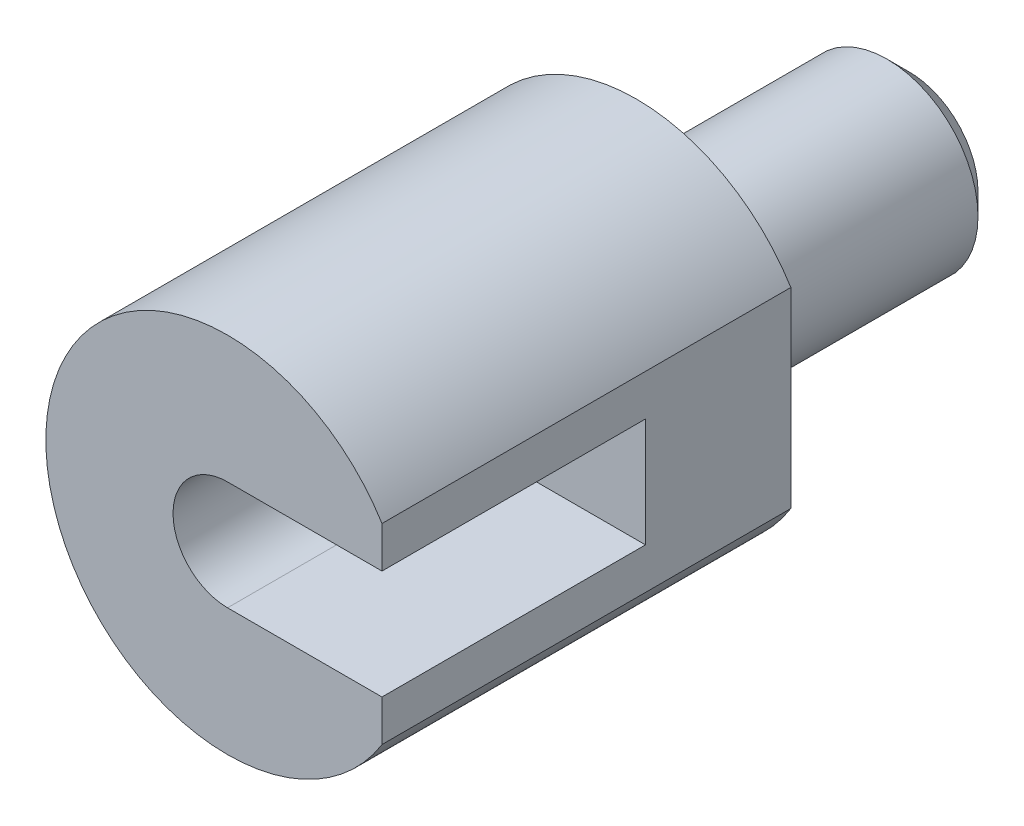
ISO-10303-21;
HEADER;
FILE_DESCRIPTION(('STEP AP214'),'2;1');
FILE_NAME('part.step','',(''),(''),'','','');
FILE_SCHEMA(('AUTOMOTIVE_DESIGN { 1 0 10303 214 1 1 1 1 }'));
ENDSEC;
DATA;
#1=APPLICATION_CONTEXT('core data for automotive mechanical design processes');
#2=APPLICATION_PROTOCOL_DEFINITION('international standard','automotive_design',2000,#1);
#3=PRODUCT_CONTEXT('',#1,'mechanical');
#4=PRODUCT('Part','Part','',(#3));
#5=PRODUCT_RELATED_PRODUCT_CATEGORY('part','',(#4));
#6=PRODUCT_DEFINITION_FORMATION('','',#4);
#7=PRODUCT_DEFINITION_CONTEXT('part definition',#1,'design');
#8=PRODUCT_DEFINITION('design','',#6,#7);
#9=PRODUCT_DEFINITION_SHAPE('','',#8);
#10=(LENGTH_UNIT() NAMED_UNIT(*) SI_UNIT(.MILLI.,.METRE.));
#11=(NAMED_UNIT(*) PLANE_ANGLE_UNIT() SI_UNIT($,.RADIAN.));
#12=(NAMED_UNIT(*) SI_UNIT($,.STERADIAN.) SOLID_ANGLE_UNIT());
#13=UNCERTAINTY_MEASURE_WITH_UNIT(LENGTH_MEASURE(1.E-05),#10,'distance_accuracy_value','');
#14=(GEOMETRIC_REPRESENTATION_CONTEXT(3) GLOBAL_UNCERTAINTY_ASSIGNED_CONTEXT((#13)) GLOBAL_UNIT_ASSIGNED_CONTEXT((#10,
#11,#12)) REPRESENTATION_CONTEXT('',''));
#15=CARTESIAN_POINT('',(0.,0.,0.));
#16=DIRECTION('',(0.,0.,1.));
#17=DIRECTION('',(1.,0.,0.));
#18=AXIS2_PLACEMENT_3D('',#15,#16,#17);
#19=CARTESIAN_POINT('',(0.,0.,0.));
#20=DIRECTION('',(0.,0.,1.));
#21=DIRECTION('',(1.,0.,0.));
#22=AXIS2_PLACEMENT_3D('',#19,#20,#21);
#23=CYLINDRICAL_SURFACE('',#22,3.);
#24=CARTESIAN_POINT('',(0.,0.,8.));
#25=DIRECTION('',(0.,0.,-1.));
#26=DIRECTION('',(-1.,0.,0.));
#27=AXIS2_PLACEMENT_3D('',#24,#25,#26);
#28=CIRCLE('',#27,3.);
#29=CARTESIAN_POINT('',(0.,3.,8.));
#30=VERTEX_POINT('',#29);
#31=CARTESIAN_POINT('',(0.,-3.,8.));
#32=VERTEX_POINT('',#31);
#33=EDGE_CURVE('E29',#30,#32,#28,.F.);
#34=ORIENTED_EDGE('',*,*,#33,.F.);
#35=DIRECTION('',(0.,0.,1.));
#36=VECTOR('',#35,1.);
#37=CARTESIAN_POINT('',(0.,3.,0.));
#38=LINE('',#37,#36);
#39=CARTESIAN_POINT('',(0.,3.,12.));
#40=VERTEX_POINT('',#39);
#41=EDGE_CURVE('E105',#30,#40,#38,.T.);
#42=ORIENTED_EDGE('',*,*,#41,.T.);
#43=CARTESIAN_POINT('',(1.5,2.59807621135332,13.5));
#44=CARTESIAN_POINT('',(1.4999945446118,2.59808302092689,13.5781617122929));
#45=CARTESIAN_POINT('',(1.49384995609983,2.60165701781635,13.6564221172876));
#46=CARTESIAN_POINT('',(1.46958481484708,2.61543549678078,13.8105408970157));
#47=CARTESIAN_POINT('',(1.45143909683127,2.62565391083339,13.8863938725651));
#48=CARTESIAN_POINT('',(1.40414992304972,2.65124019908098,14.0331774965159));
#49=CARTESIAN_POINT('',(1.3750649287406,2.66658065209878,14.1041319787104));
#50=CARTESIAN_POINT('',(1.30690128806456,2.70063997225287,14.2401363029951));
#51=CARTESIAN_POINT('',(1.26782210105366,2.71935902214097,14.3051858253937));
#52=CARTESIAN_POINT('',(1.17699981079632,2.75995303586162,14.4334585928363));
#53=CARTESIAN_POINT('',(1.12447805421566,2.7819609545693,14.4960887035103));
#54=CARTESIAN_POINT('',(1.0098807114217,2.82557974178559,14.6121125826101));
#55=CARTESIAN_POINT('',(0.947800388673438,2.84719040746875,14.6655017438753));
#56=CARTESIAN_POINT('',(0.810734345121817,2.88932215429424,14.7650507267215));
#57=CARTESIAN_POINT('',(0.735160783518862,2.90967159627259,14.8104806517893));
#58=CARTESIAN_POINT('',(0.576235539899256,2.94526134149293,14.8877112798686));
#59=CARTESIAN_POINT('',(0.492888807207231,2.96050486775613,14.9195205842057));
#60=CARTESIAN_POINT('',(0.327067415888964,2.98320691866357,14.9662569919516));
#61=CARTESIAN_POINT('',(0.244952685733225,2.99114220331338,14.9822242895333));
#62=CARTESIAN_POINT('',(0.0788559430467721,3.000113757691,15.0002491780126));
#63=CARTESIAN_POINT('',(-0.00512490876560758,3.00115420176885,15.0023151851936));
#64=CARTESIAN_POINT('',(-0.164748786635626,2.99644472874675,14.9928799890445));
#65=CARTESIAN_POINT('',(-0.24048179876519,2.99127743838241,14.9825429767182));
#66=CARTESIAN_POINT('',(-0.388970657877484,2.97561367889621,14.950678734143));
#67=CARTESIAN_POINT('',(-0.461726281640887,2.96511681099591,14.9291506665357));
#68=CARTESIAN_POINT('',(-0.60346408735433,2.93957374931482,14.8753761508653));
#69=CARTESIAN_POINT('',(-0.67238013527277,2.92446662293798,14.8429855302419));
#70=CARTESIAN_POINT('',(-0.803965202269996,2.89106468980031,14.7686048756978));
#71=CARTESIAN_POINT('',(-0.866631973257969,2.87276874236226,14.7266114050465));
#72=CARTESIAN_POINT('',(-0.990260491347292,2.83266591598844,14.6296569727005));
#73=CARTESIAN_POINT('',(-1.05050111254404,2.81069063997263,14.573845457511));
#74=CARTESIAN_POINT('',(-1.16115655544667,2.76681510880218,14.4531154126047));
#75=CARTESIAN_POINT('',(-1.21156381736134,2.74491492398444,14.3881899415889));
#76=CARTESIAN_POINT('',(-1.30425800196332,2.70216234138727,14.2460277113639));
#77=CARTESIAN_POINT('',(-1.34582597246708,2.68146479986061,14.1682709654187));
#78=CARTESIAN_POINT('',(-1.41497866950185,2.64563175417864,14.0055934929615));
#79=CARTESIAN_POINT('',(-1.44257798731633,2.63049045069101,13.9206803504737));
#80=CARTESIAN_POINT('',(-1.48077031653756,2.60916953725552,13.7531782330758));
#81=CARTESIAN_POINT('',(-1.49253768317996,2.60237483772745,13.6709383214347));
#82=CARTESIAN_POINT('',(-1.50227541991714,2.59676879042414,13.5053979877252));
#83=CARTESIAN_POINT('',(-1.50025553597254,2.59795180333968,13.4220983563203));
#84=CARTESIAN_POINT('',(-1.48355406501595,2.60751504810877,13.2665191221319));
#85=CARTESIAN_POINT('',(-1.4702817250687,2.61509381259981,13.1940308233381));
#86=CARTESIAN_POINT('',(-1.43354442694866,2.63541032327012,13.0524483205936));
#87=CARTESIAN_POINT('',(-1.41007616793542,2.64814974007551,12.9833552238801));
#88=CARTESIAN_POINT('',(-1.35247138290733,2.67804333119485,12.846883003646));
#89=CARTESIAN_POINT('',(-1.31789109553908,2.69537464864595,12.7797314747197));
#90=CARTESIAN_POINT('',(-1.2394305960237,2.73234179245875,12.6517960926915));
#91=CARTESIAN_POINT('',(-1.19554560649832,2.75197880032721,12.5910155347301));
#92=CARTESIAN_POINT('',(-1.09325575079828,2.79431997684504,12.4695318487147));
#93=CARTESIAN_POINT('',(-1.03371790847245,2.81709874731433,12.4098042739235));
#94=CARTESIAN_POINT('',(-0.905106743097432,2.86101352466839,12.3008816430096));
#95=CARTESIAN_POINT('',(-0.836030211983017,2.88214897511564,12.2516901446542));
#96=CARTESIAN_POINT('',(-0.687803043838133,2.92112042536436,12.1641394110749));
#97=CARTESIAN_POINT('',(-0.608434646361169,2.93885462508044,12.1261003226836));
#98=CARTESIAN_POINT('',(-0.443283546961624,2.96825032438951,12.0642931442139));
#99=CARTESIAN_POINT('',(-0.357506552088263,2.9799171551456,12.0405125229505));
#100=CARTESIAN_POINT('',(-0.190469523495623,2.99501262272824,12.009947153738));
#101=CARTESIAN_POINT('',(-0.109517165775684,2.99909891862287,12.0018031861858));
#102=CARTESIAN_POINT('',(0.0526889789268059,3.00063195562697,11.9987351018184));
#103=CARTESIAN_POINT('',(0.13394265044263,2.99808102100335,12.0038063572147));
#104=CARTESIAN_POINT('',(0.288806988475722,2.98700953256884,12.0261246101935));
#105=CARTESIAN_POINT('',(0.362568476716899,2.97889342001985,12.0425472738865));
#106=CARTESIAN_POINT('',(0.506168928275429,2.95788140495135,12.0859904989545));
#107=CARTESIAN_POINT('',(0.576007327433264,2.94498481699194,12.1130125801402));
#108=CARTESIAN_POINT('',(0.713135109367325,2.91488896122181,12.178090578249));
#109=CARTESIAN_POINT('',(0.780187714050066,2.89752925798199,12.2165689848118));
#110=CARTESIAN_POINT('',(0.907161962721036,2.86032199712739,12.3029368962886));
#111=CARTESIAN_POINT('',(0.967080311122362,2.84047329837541,12.3508307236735));
#112=CARTESIAN_POINT('',(1.08437100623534,2.79792915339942,12.460195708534));
#113=CARTESIAN_POINT('',(1.14089652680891,2.77514698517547,12.5225437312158));
#114=CARTESIAN_POINT('',(1.24299493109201,2.73094614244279,12.6561760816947));
#115=CARTESIAN_POINT('',(1.28855812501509,2.70952868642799,12.7274682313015));
#116=CARTESIAN_POINT('',(1.36864661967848,2.66999407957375,12.8799549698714));
#117=CARTESIAN_POINT('',(1.40277759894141,2.65200261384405,12.9613912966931));
#118=CARTESIAN_POINT('',(1.45631806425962,2.62299234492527,13.1299986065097));
#119=CARTESIAN_POINT('',(1.47577678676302,2.61195024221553,13.217149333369));
#120=CARTESIAN_POINT('',(1.49155051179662,2.60293908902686,13.337708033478));
#121=CARTESIAN_POINT('',(1.49471415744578,2.60112193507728,13.3700518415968));
#122=CARTESIAN_POINT('',(1.49894010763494,2.59868903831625,13.4349247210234));
#123=CARTESIAN_POINT('',(1.50000227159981,2.59807337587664,13.4674538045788));
#124=CARTESIAN_POINT('',(1.5,2.59807621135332,13.5));
#125=B_SPLINE_CURVE_WITH_KNOTS('',3,(#43,#44,#45,#46,#47,#48,#49,#50,#51,#52,#53,#54,#55,#56,
#57,#58,#59,#60,#61,#62,#63,#64,#65,#66,#67,#68,#69,#70,#71,#72,#73,#74,#75,#76,#77,#78,#79,#80,
#81,#82,#83,#84,#85,#86,#87,#88,#89,#90,#91,#92,#93,#94,#95,#96,#97,#98,#99,#100,#101,#102,#103,
#104,#105,#106,#107,#108,#109,#110,#111,#112,#113,#114,#115,#116,#117,#118,#119,#120,#121,#122,
#123,#124),.UNSPECIFIED.,.T.,.F.,(4,2,2,2,2,2,2,2,2,2,2,2,2,2,2,2,2,2,2,2,2,2,2,2,2,2,2,2,2,2,2,
2,2,2,2,2,2,2,2,2,4),(0.,0.234348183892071,0.469189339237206,0.702792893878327,
0.936409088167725,1.18929346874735,1.44230356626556,1.71236838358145,1.98226240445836,
2.23295227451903,2.4834903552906,2.71224146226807,2.94100968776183,3.1729430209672,
3.40495949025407,3.65890787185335,3.91305072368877,4.18333262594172,4.45333161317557,
4.70193436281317,4.95036139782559,5.17161275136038,5.39293578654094,5.62450944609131,
5.85620229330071,6.11710115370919,6.37808797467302,6.64596272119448,6.91360169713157,
7.15668405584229,7.39968130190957,7.62666637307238,7.85368400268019,8.09041126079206,
8.32724745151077,8.587653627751,8.8482891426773,9.11716123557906,9.38512699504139,
9.48270202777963,9.5802835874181),.UNSPECIFIED.);
#126=CARTESIAN_POINT('',(0.,3.,15.));
#127=VERTEX_POINT('',#126);
#128=EDGE_CURVE('E99',#127,#40,#125,.T.);
#129=ORIENTED_EDGE('',*,*,#128,.F.);
#130=CARTESIAN_POINT('',(0.,3.,22.5));
#131=VERTEX_POINT('',#130);
#132=EDGE_CURVE('E103',#127,#131,#38,.T.);
#133=ORIENTED_EDGE('',*,*,#132,.T.);
#134=CARTESIAN_POINT('',(0.,0.,22.5));
#135=DIRECTION('',(0.,0.,1.));
#136=DIRECTION('',(1.,0.,0.));
#137=AXIS2_PLACEMENT_3D('',#134,#135,#136);
#138=CIRCLE('',#137,3.);
#139=CARTESIAN_POINT('',(0.,-3.,22.5));
#140=VERTEX_POINT('',#139);
#141=EDGE_CURVE('E106',#131,#140,#138,.T.);
#142=ORIENTED_EDGE('',*,*,#141,.T.);
#143=DIRECTION('',(0.,0.,1.));
#144=VECTOR('',#143,1.);
#145=CARTESIAN_POINT('',(0.,-3.,0.));
#146=LINE('',#145,#144);
#147=CARTESIAN_POINT('',(0.,-3.,15.));
#148=VERTEX_POINT('',#147);
#149=EDGE_CURVE('E81',#148,#140,#146,.T.);
#150=ORIENTED_EDGE('',*,*,#149,.F.);
#151=CARTESIAN_POINT('',(1.5,-2.59807621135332,13.5));
#152=CARTESIAN_POINT('',(1.4999945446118,-2.59808302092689,13.4218382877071));
#153=CARTESIAN_POINT('',(1.49384995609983,-2.60165701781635,13.3435778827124));
#154=CARTESIAN_POINT('',(1.46958481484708,-2.61543549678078,13.1894591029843));
#155=CARTESIAN_POINT('',(1.45143909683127,-2.62565391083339,13.1136061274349));
#156=CARTESIAN_POINT('',(1.40414992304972,-2.65124019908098,12.9668225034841));
#157=CARTESIAN_POINT('',(1.3750649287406,-2.66658065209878,12.8958680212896));
#158=CARTESIAN_POINT('',(1.30690128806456,-2.70063997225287,12.7598636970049));
#159=CARTESIAN_POINT('',(1.26782210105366,-2.71935902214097,12.6948141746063));
#160=CARTESIAN_POINT('',(1.17699981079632,-2.75995303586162,12.5665414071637));
#161=CARTESIAN_POINT('',(1.12447805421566,-2.7819609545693,12.5039112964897));
#162=CARTESIAN_POINT('',(1.0098807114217,-2.82557974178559,12.3878874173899));
#163=CARTESIAN_POINT('',(0.947800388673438,-2.84719040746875,12.3344982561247));
#164=CARTESIAN_POINT('',(0.810734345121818,-2.88932215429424,12.2349492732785));
#165=CARTESIAN_POINT('',(0.735160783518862,-2.90967159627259,12.1895193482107));
#166=CARTESIAN_POINT('',(0.576235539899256,-2.94526134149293,12.1122887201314));
#167=CARTESIAN_POINT('',(0.492888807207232,-2.96050486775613,12.0804794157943));
#168=CARTESIAN_POINT('',(0.327067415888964,-2.98320691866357,12.0337430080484));
#169=CARTESIAN_POINT('',(0.244952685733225,-2.99114220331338,12.0177757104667));
#170=CARTESIAN_POINT('',(0.0788559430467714,-3.000113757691,11.9997508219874));
#171=CARTESIAN_POINT('',(-0.00512490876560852,-3.00115420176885,11.9976848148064));
#172=CARTESIAN_POINT('',(-0.164748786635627,-2.99644472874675,12.0071200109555));
#173=CARTESIAN_POINT('',(-0.240481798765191,-2.99127743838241,12.0174570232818));
#174=CARTESIAN_POINT('',(-0.388970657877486,-2.97561367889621,12.049321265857));
#175=CARTESIAN_POINT('',(-0.461726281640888,-2.96511681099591,12.0708493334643));
#176=CARTESIAN_POINT('',(-0.603464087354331,-2.93957374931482,12.1246238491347));
#177=CARTESIAN_POINT('',(-0.672380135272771,-2.92446662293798,12.1570144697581));
#178=CARTESIAN_POINT('',(-0.803965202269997,-2.89106468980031,12.2313951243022));
#179=CARTESIAN_POINT('',(-0.86663197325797,-2.87276874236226,12.2733885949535));
#180=CARTESIAN_POINT('',(-0.990260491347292,-2.83266591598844,12.3703430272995));
#181=CARTESIAN_POINT('',(-1.05050111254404,-2.81069063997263,12.426154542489));
#182=CARTESIAN_POINT('',(-1.16115655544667,-2.76681510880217,12.5468845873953));
#183=CARTESIAN_POINT('',(-1.21156381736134,-2.74491492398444,12.6118100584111));
#184=CARTESIAN_POINT('',(-1.30425800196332,-2.70216234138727,12.7539722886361));
#185=CARTESIAN_POINT('',(-1.34582597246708,-2.68146479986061,12.8317290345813));
#186=CARTESIAN_POINT('',(-1.41497866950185,-2.64563175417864,12.9944065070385));
#187=CARTESIAN_POINT('',(-1.44257798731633,-2.63049045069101,13.0793196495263));
#188=CARTESIAN_POINT('',(-1.48077031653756,-2.60916953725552,13.2468217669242));
#189=CARTESIAN_POINT('',(-1.49253768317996,-2.60237483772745,13.3290616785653));
#190=CARTESIAN_POINT('',(-1.50227541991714,-2.59676879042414,13.4946020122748));
#191=CARTESIAN_POINT('',(-1.50025553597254,-2.59795180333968,13.5779016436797));
#192=CARTESIAN_POINT('',(-1.48355406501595,-2.60751504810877,13.7334808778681));
#193=CARTESIAN_POINT('',(-1.4702817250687,-2.61509381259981,13.8059691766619));
#194=CARTESIAN_POINT('',(-1.43354442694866,-2.63541032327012,13.9475516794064));
#195=CARTESIAN_POINT('',(-1.41007616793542,-2.64814974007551,14.0166447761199));
#196=CARTESIAN_POINT('',(-1.35247138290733,-2.67804333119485,14.153116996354));
#197=CARTESIAN_POINT('',(-1.31789109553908,-2.69537464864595,14.2202685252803));
#198=CARTESIAN_POINT('',(-1.2394305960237,-2.73234179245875,14.3482039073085));
#199=CARTESIAN_POINT('',(-1.19554560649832,-2.75197880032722,14.4089844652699));
#200=CARTESIAN_POINT('',(-1.09325575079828,-2.79431997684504,14.5304681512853));
#201=CARTESIAN_POINT('',(-1.03371790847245,-2.81709874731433,14.5901957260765));
#202=CARTESIAN_POINT('',(-0.905106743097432,-2.86101352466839,14.6991183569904));
#203=CARTESIAN_POINT('',(-0.836030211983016,-2.88214897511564,14.7483098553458));
#204=CARTESIAN_POINT('',(-0.687803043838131,-2.92112042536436,14.8358605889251));
#205=CARTESIAN_POINT('',(-0.608434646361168,-2.93885462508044,14.8738996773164));
#206=CARTESIAN_POINT('',(-0.443283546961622,-2.96825032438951,14.9357068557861));
#207=CARTESIAN_POINT('',(-0.357506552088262,-2.9799171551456,14.9594874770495));
#208=CARTESIAN_POINT('',(-0.190469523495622,-2.99501262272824,14.990052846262));
#209=CARTESIAN_POINT('',(-0.109517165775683,-2.99909891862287,14.9981968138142));
#210=CARTESIAN_POINT('',(0.0526889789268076,-3.00063195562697,15.0012648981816));
#211=CARTESIAN_POINT('',(0.133942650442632,-2.99808102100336,14.9961936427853));
#212=CARTESIAN_POINT('',(0.288806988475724,-2.98700953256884,14.9738753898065));
#213=CARTESIAN_POINT('',(0.3625684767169,-2.97889342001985,14.9574527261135));
#214=CARTESIAN_POINT('',(0.506168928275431,-2.95788140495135,14.9140095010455));
#215=CARTESIAN_POINT('',(0.576007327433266,-2.94498481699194,14.8869874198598));
#216=CARTESIAN_POINT('',(0.713135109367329,-2.9148889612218,14.821909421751));
#217=CARTESIAN_POINT('',(0.780187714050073,-2.89752925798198,14.7834310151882));
#218=CARTESIAN_POINT('',(0.90716196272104,-2.86032199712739,14.6970631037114));
#219=CARTESIAN_POINT('',(0.967080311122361,-2.84047329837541,14.6491692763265));
#220=CARTESIAN_POINT('',(1.08437100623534,-2.79792915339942,14.5398042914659));
#221=CARTESIAN_POINT('',(1.14089652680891,-2.77514698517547,14.4774562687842));
#222=CARTESIAN_POINT('',(1.24299493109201,-2.73094614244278,14.3438239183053));
#223=CARTESIAN_POINT('',(1.28855812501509,-2.70952868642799,14.2725317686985));
#224=CARTESIAN_POINT('',(1.36864661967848,-2.66999407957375,14.1200450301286));
#225=CARTESIAN_POINT('',(1.40277759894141,-2.65200261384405,14.0386087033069));
#226=CARTESIAN_POINT('',(1.45631806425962,-2.62299234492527,13.8700013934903));
#227=CARTESIAN_POINT('',(1.47577678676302,-2.61195024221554,13.782850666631));
#228=CARTESIAN_POINT('',(1.49155051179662,-2.60293908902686,13.662291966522));
#229=CARTESIAN_POINT('',(1.49471415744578,-2.60112193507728,13.6299481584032));
#230=CARTESIAN_POINT('',(1.49894010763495,-2.59868903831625,13.5650752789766));
#231=CARTESIAN_POINT('',(1.50000227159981,-2.59807337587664,13.5325461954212));
#232=CARTESIAN_POINT('',(1.5,-2.59807621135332,13.5));
#233=B_SPLINE_CURVE_WITH_KNOTS('',3,(#151,#152,#153,#154,#155,#156,#157,#158,#159,#160,#161,
#162,#163,#164,#165,#166,#167,#168,#169,#170,#171,#172,#173,#174,#175,#176,#177,#178,#179,#180,
#181,#182,#183,#184,#185,#186,#187,#188,#189,#190,#191,#192,#193,#194,#195,#196,#197,#198,#199,
#200,#201,#202,#203,#204,#205,#206,#207,#208,#209,#210,#211,#212,#213,#214,#215,#216,#217,#218,
#219,#220,#221,#222,#223,#224,#225,#226,#227,#228,#229,#230,#231,#232),.UNSPECIFIED.,.T.,.F.,(4,
2,2,2,2,2,2,2,2,2,2,2,2,2,2,2,2,2,2,2,2,2,2,2,2,2,2,2,2,2,2,2,2,2,2,2,2,2,2,2,4),(0.,
0.234348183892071,0.469189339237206,0.702792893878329,0.936409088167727,1.18929346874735,
1.44230356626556,1.71236838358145,1.98226240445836,2.23295227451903,2.4834903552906,
2.71224146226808,2.94100968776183,3.1729430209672,3.40495949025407,3.65890787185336,
3.91305072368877,4.18333262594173,4.45333161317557,4.70193436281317,4.95036139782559,
5.17161275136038,5.39293578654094,5.62450944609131,5.85620229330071,6.11710115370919,
6.37808797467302,6.64596272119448,6.91360169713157,7.1566840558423,7.39968130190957,
7.62666637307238,7.85368400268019,8.09041126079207,8.32724745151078,8.587653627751,
8.84828914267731,9.11716123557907,9.38512699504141,9.48270202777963,9.5802835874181),.UNSPECIFIED.);
#234=CARTESIAN_POINT('',(0.,-3.,12.));
#235=VERTEX_POINT('',#234);
#236=EDGE_CURVE('E84',#235,#148,#233,.T.);
#237=ORIENTED_EDGE('',*,*,#236,.F.);
#238=EDGE_CURVE('E76',#32,#235,#146,.T.);
#239=ORIENTED_EDGE('',*,*,#238,.F.);
#240=EDGE_LOOP('',(#34,#42,#129,#133,#142,#150,#237,#239));
#241=FACE_BOUND('',#240,.T.);
#242=ADVANCED_FACE('F14',(#241),#23,.F.);
#243=CARTESIAN_POINT('',(0.,3.,0.));
#244=DIRECTION('',(0.,-1.,0.));
#245=DIRECTION('',(1.,0.,0.));
#246=AXIS2_PLACEMENT_3D('',#243,#244,#245);
#247=PLANE('',#246);
#248=ORIENTED_EDGE('',*,*,#41,.F.);
#249=DIRECTION('',(1.,0.,0.));
#250=VECTOR('',#249,1.);
#251=CARTESIAN_POINT('',(0.,3.,8.));
#252=LINE('',#251,#250);
#253=CARTESIAN_POINT('',(8.5,3.,8.));
#254=VERTEX_POINT('',#253);
#255=EDGE_CURVE('E88',#30,#254,#252,.T.);
#256=ORIENTED_EDGE('',*,*,#255,.T.);
#257=DIRECTION('',(0.,0.,1.));
#258=VECTOR('',#257,1.);
#259=CARTESIAN_POINT('',(8.5,3.,0.));
#260=LINE('',#259,#258);
#261=CARTESIAN_POINT('',(8.5,3.,22.5));
#262=VERTEX_POINT('',#261);
#263=EDGE_CURVE('E112',#254,#262,#260,.T.);
#264=ORIENTED_EDGE('',*,*,#263,.T.);
#265=DIRECTION('',(1.,0.,0.));
#266=VECTOR('',#265,1.);
#267=CARTESIAN_POINT('',(0.,3.,22.5));
#268=LINE('',#267,#266);
#269=EDGE_CURVE('E110',#131,#262,#268,.T.);
#270=ORIENTED_EDGE('',*,*,#269,.F.);
#271=ORIENTED_EDGE('',*,*,#132,.F.);
#272=CARTESIAN_POINT('',(0.,3.,13.5));
#273=DIRECTION('',(0.,-1.,0.));
#274=DIRECTION('',(1.,0.,0.));
#275=AXIS2_PLACEMENT_3D('',#272,#273,#274);
#276=CIRCLE('',#275,1.5);
#277=EDGE_CURVE('E87',#127,#40,#276,.F.);
#278=ORIENTED_EDGE('',*,*,#277,.T.);
#279=EDGE_LOOP('',(#248,#256,#264,#270,#271,#278));
#280=FACE_BOUND('',#279,.T.);
#281=ADVANCED_FACE('F108',(#280),#247,.T.);
#282=CARTESIAN_POINT('',(0.,-3.,0.));
#283=DIRECTION('',(0.,-1.,0.));
#284=DIRECTION('',(1.,0.,0.));
#285=AXIS2_PLACEMENT_3D('',#282,#283,#284);
#286=PLANE('',#285);
#287=DIRECTION('',(1.,0.,0.));
#288=VECTOR('',#287,1.);
#289=CARTESIAN_POINT('',(0.,-3.,8.));
#290=LINE('',#289,#288);
#291=CARTESIAN_POINT('',(8.5,-3.,8.));
#292=VERTEX_POINT('',#291);
#293=EDGE_CURVE('E37',#32,#292,#290,.T.);
#294=ORIENTED_EDGE('',*,*,#293,.F.);
#295=ORIENTED_EDGE('',*,*,#238,.T.);
#296=CARTESIAN_POINT('',(0.,-3.,13.5));
#297=DIRECTION('',(0.,-1.,0.));
#298=DIRECTION('',(1.,0.,0.));
#299=AXIS2_PLACEMENT_3D('',#296,#297,#298);
#300=CIRCLE('',#299,1.5);
#301=EDGE_CURVE('E9',#148,#235,#300,.F.);
#302=ORIENTED_EDGE('',*,*,#301,.F.);
#303=ORIENTED_EDGE('',*,*,#149,.T.);
#304=DIRECTION('',(1.,0.,0.));
#305=VECTOR('',#304,1.);
#306=CARTESIAN_POINT('',(0.,-3.,22.5));
#307=LINE('',#306,#305);
#308=CARTESIAN_POINT('',(8.5,-3.,22.5));
#309=VERTEX_POINT('',#308);
#310=EDGE_CURVE('E149',#140,#309,#307,.T.);
#311=ORIENTED_EDGE('',*,*,#310,.T.);
#312=DIRECTION('',(0.,0.,1.));
#313=VECTOR('',#312,1.);
#314=CARTESIAN_POINT('',(8.5,-3.,0.));
#315=LINE('',#314,#313);
#316=EDGE_CURVE('E80',#292,#309,#315,.T.);
#317=ORIENTED_EDGE('',*,*,#316,.F.);
#318=EDGE_LOOP('',(#294,#295,#302,#303,#311,#317));
#319=FACE_BOUND('',#318,.T.);
#320=ADVANCED_FACE('F78',(#319),#286,.F.);
#321=CARTESIAN_POINT('',(0.,0.,22.5));
#322=DIRECTION('',(0.,0.,1.));
#323=DIRECTION('',(1.,0.,0.));
#324=AXIS2_PLACEMENT_3D('',#321,#322,#323);
#325=PLANE('',#324);
#326=ORIENTED_EDGE('',*,*,#269,.T.);
#327=DIRECTION('',(0.,1.,0.));
#328=VECTOR('',#327,1.);
#329=CARTESIAN_POINT('',(8.5,3.,22.5));
#330=LINE('',#329,#328);
#331=CARTESIAN_POINT('',(8.5,5.26782687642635,22.5));
#332=VERTEX_POINT('',#331);
#333=EDGE_CURVE('E138',#262,#332,#330,.T.);
#334=ORIENTED_EDGE('',*,*,#333,.T.);
#335=CARTESIAN_POINT('',(0.,0.,22.5));
#336=DIRECTION('',(0.,0.,1.));
#337=DIRECTION('',(1.,0.,0.));
#338=AXIS2_PLACEMENT_3D('',#335,#336,#337);
#339=CIRCLE('',#338,10.);
#340=CARTESIAN_POINT('',(8.5,-5.26782687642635,22.5));
#341=VERTEX_POINT('',#340);
#342=EDGE_CURVE('E22',#332,#341,#339,.T.);
#343=ORIENTED_EDGE('',*,*,#342,.T.);
#344=DIRECTION('',(0.,1.,0.));
#345=VECTOR('',#344,1.);
#346=CARTESIAN_POINT('',(8.5,-5.26782687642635,22.5));
#347=LINE('',#346,#345);
#348=EDGE_CURVE('E136',#341,#309,#347,.T.);
#349=ORIENTED_EDGE('',*,*,#348,.T.);
#350=ORIENTED_EDGE('',*,*,#310,.F.);
#351=ORIENTED_EDGE('',*,*,#141,.F.);
#352=EDGE_LOOP('',(#326,#334,#343,#349,#350,#351));
#353=FACE_BOUND('',#352,.T.);
#354=ADVANCED_FACE('F16',(#353),#325,.T.);
#355=CARTESIAN_POINT('',(0.,0.,22.5));
#356=DIRECTION('',(0.,0.,1.));
#357=DIRECTION('',(1.,0.,0.));
#358=AXIS2_PLACEMENT_3D('',#355,#356,#357);
#359=CYLINDRICAL_SURFACE('',#358,10.);
#360=DIRECTION('',(0.,0.,1.));
#361=VECTOR('',#360,1.);
#362=CARTESIAN_POINT('',(8.5,-5.26782687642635,0.));
#363=LINE('',#362,#361);
#364=CARTESIAN_POINT('',(8.5,-5.26782687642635,0.));
#365=VERTEX_POINT('',#364);
#366=EDGE_CURVE('E144',#365,#341,#363,.T.);
#367=ORIENTED_EDGE('',*,*,#366,.T.);
#368=ORIENTED_EDGE('',*,*,#342,.F.);
#369=DIRECTION('',(0.,0.,1.));
#370=VECTOR('',#369,1.);
#371=CARTESIAN_POINT('',(8.5,5.26782687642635,0.));
#372=LINE('',#371,#370);
#373=CARTESIAN_POINT('',(8.5,5.26782687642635,0.));
#374=VERTEX_POINT('',#373);
#375=EDGE_CURVE('E115',#374,#332,#372,.T.);
#376=ORIENTED_EDGE('',*,*,#375,.F.);
#377=CARTESIAN_POINT('',(0.,0.,0.));
#378=DIRECTION('',(0.,0.,1.));
#379=DIRECTION('',(1.,0.,0.));
#380=AXIS2_PLACEMENT_3D('',#377,#378,#379);
#381=CIRCLE('',#380,10.);
#382=EDGE_CURVE('E127',#374,#365,#381,.T.);
#383=ORIENTED_EDGE('',*,*,#382,.T.);
#384=EDGE_LOOP('',(#367,#368,#376,#383));
#385=FACE_BOUND('',#384,.T.);
#386=ADVANCED_FACE('F141',(#385),#359,.T.);
#387=CARTESIAN_POINT('',(0.,-5.,0.));
#388=DIRECTION('',(0.,0.,1.));
#389=DIRECTION('',(1.,0.,0.));
#390=AXIS2_PLACEMENT_3D('',#387,#388,#389);
#391=PLANE('',#390);
#392=DIRECTION('',(0.,1.,0.));
#393=VECTOR('',#392,1.);
#394=CARTESIAN_POINT('',(8.5,3.,0.));
#395=LINE('',#394,#393);
#396=EDGE_CURVE('E156',#365,#374,#395,.T.);
#397=ORIENTED_EDGE('',*,*,#396,.F.);
#398=ORIENTED_EDGE('',*,*,#382,.F.);
#399=EDGE_LOOP('',(#397,#398));
#400=FACE_BOUND('',#399,.T.);
#401=CARTESIAN_POINT('',(0.,0.,0.));
#402=DIRECTION('',(0.,0.,1.));
#403=DIRECTION('',(1.,0.,0.));
#404=AXIS2_PLACEMENT_3D('',#401,#402,#403);
#405=CIRCLE('',#404,5.);
#406=CARTESIAN_POINT('',(5.,0.,0.));
#407=VERTEX_POINT('',#406);
#408=EDGE_CURVE('E124',#407,#407,#405,.T.);
#409=ORIENTED_EDGE('',*,*,#408,.T.);
#410=EDGE_LOOP('',(#409));
#411=FACE_BOUND('',#410,.T.);
#412=ADVANCED_FACE('F160',(#400,#411),#391,.F.);
#413=CARTESIAN_POINT('',(0.,0.,22.5));
#414=DIRECTION('',(0.,0.,1.));
#415=DIRECTION('',(1.,0.,0.));
#416=AXIS2_PLACEMENT_3D('',#413,#414,#415);
#417=CYLINDRICAL_SURFACE('',#416,5.);
#418=ORIENTED_EDGE('',*,*,#408,.F.);
#419=EDGE_LOOP('',(#418));
#420=FACE_BOUND('',#419,.T.);
#421=CARTESIAN_POINT('',(0.,0.,-13.8));
#422=DIRECTION('',(0.,0.,1.));
#423=DIRECTION('',(1.,0.,0.));
#424=AXIS2_PLACEMENT_3D('',#421,#422,#423);
#425=CIRCLE('',#424,5.);
#426=CARTESIAN_POINT('',(5.,0.,-13.8));
#427=VERTEX_POINT('',#426);
#428=EDGE_CURVE('E121',#427,#427,#425,.T.);
#429=ORIENTED_EDGE('',*,*,#428,.T.);
#430=EDGE_LOOP('',(#429));
#431=FACE_BOUND('',#430,.T.);
#432=ADVANCED_FACE('F163',(#420,#431),#417,.T.);
#433=CARTESIAN_POINT('',(0.,0.,-15.));
#434=DIRECTION('',(0.,0.,1.));
#435=DIRECTION('',(1.,0.,0.));
#436=AXIS2_PLACEMENT_3D('',#433,#434,#435);
#437=CONICAL_SURFACE('',#436,3.8,0.785398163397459);
#438=ORIENTED_EDGE('',*,*,#428,.F.);
#439=EDGE_LOOP('',(#438));
#440=FACE_BOUND('',#439,.T.);
#441=CARTESIAN_POINT('',(0.,0.,-15.));
#442=DIRECTION('',(0.,0.,1.));
#443=DIRECTION('',(1.,0.,0.));
#444=AXIS2_PLACEMENT_3D('',#441,#442,#443);
#445=CIRCLE('',#444,3.8);
#446=CARTESIAN_POINT('',(3.8,0.,-15.));
#447=VERTEX_POINT('',#446);
#448=EDGE_CURVE('E114',#447,#447,#445,.T.);
#449=ORIENTED_EDGE('',*,*,#448,.T.);
#450=EDGE_LOOP('',(#449));
#451=FACE_BOUND('',#450,.T.);
#452=ADVANCED_FACE('F169',(#440,#451),#437,.T.);
#453=CARTESIAN_POINT('',(0.,-3.8,-15.));
#454=DIRECTION('',(0.,0.,-1.));
#455=DIRECTION('',(-1.,0.,0.));
#456=AXIS2_PLACEMENT_3D('',#453,#454,#455);
#457=PLANE('',#456);
#458=ORIENTED_EDGE('',*,*,#448,.F.);
#459=EDGE_LOOP('',(#458));
#460=FACE_BOUND('',#459,.T.);
#461=ADVANCED_FACE('F175',(#460),#457,.T.);
#462=CARTESIAN_POINT('',(8.5,3.,0.));
#463=DIRECTION('',(1.,0.,0.));
#464=DIRECTION('',(0.,1.,0.));
#465=AXIS2_PLACEMENT_3D('',#462,#463,#464);
#466=PLANE('',#465);
#467=ORIENTED_EDGE('',*,*,#375,.T.);
#468=ORIENTED_EDGE('',*,*,#333,.F.);
#469=ORIENTED_EDGE('',*,*,#263,.F.);
#470=DIRECTION('',(0.,-1.,0.));
#471=VECTOR('',#470,1.);
#472=CARTESIAN_POINT('',(8.5,5.26782687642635,8.));
#473=LINE('',#472,#471);
#474=EDGE_CURVE('E209',#254,#292,#473,.T.);
#475=ORIENTED_EDGE('',*,*,#474,.T.);
#476=ORIENTED_EDGE('',*,*,#316,.T.);
#477=ORIENTED_EDGE('',*,*,#348,.F.);
#478=ORIENTED_EDGE('',*,*,#366,.F.);
#479=ORIENTED_EDGE('',*,*,#396,.T.);
#480=EDGE_LOOP('',(#467,#468,#469,#475,#476,#477,#478,#479));
#481=FACE_BOUND('',#480,.T.);
#482=ADVANCED_FACE('F94',(#481),#466,.T.);
#483=CARTESIAN_POINT('',(0.,-10.,13.5));
#484=DIRECTION('',(0.,-1.,0.));
#485=DIRECTION('',(1.,0.,0.));
#486=AXIS2_PLACEMENT_3D('',#483,#484,#485);
#487=CYLINDRICAL_SURFACE('',#486,1.5);
#488=ORIENTED_EDGE('',*,*,#301,.T.);
#489=ORIENTED_EDGE('',*,*,#236,.T.);
#490=EDGE_LOOP('',(#488,#489));
#491=FACE_BOUND('',#490,.T.);
#492=ORIENTED_EDGE('',*,*,#277,.F.);
#493=ORIENTED_EDGE('',*,*,#128,.T.);
#494=EDGE_LOOP('',(#492,#493));
#495=FACE_BOUND('',#494,.T.);
#496=ADVANCED_FACE('F90',(#491,#495),#487,.T.);
#497=CARTESIAN_POINT('',(0.,0.,8.));
#498=DIRECTION('',(0.,0.,-1.));
#499=DIRECTION('',(-1.,0.,0.));
#500=AXIS2_PLACEMENT_3D('',#497,#498,#499);
#501=PLANE('',#500);
#502=ORIENTED_EDGE('',*,*,#255,.F.);
#503=ORIENTED_EDGE('',*,*,#33,.T.);
#504=ORIENTED_EDGE('',*,*,#293,.T.);
#505=ORIENTED_EDGE('',*,*,#474,.F.);
#506=EDGE_LOOP('',(#502,#503,#504,#505));
#507=FACE_BOUND('',#506,.T.);
#508=ADVANCED_FACE('F93',(#507),#501,.F.);
#509=CLOSED_SHELL('',(#242,#281,#320,#354,#386,#412,#432,#452,#461,#482,#496,#508));
#510=MANIFOLD_SOLID_BREP('B1',#509);
#511=ADVANCED_BREP_SHAPE_REPRESENTATION('',(#18,#510),#14);
#512=SHAPE_DEFINITION_REPRESENTATION(#9,#511);
ENDSEC;
END-ISO-10303-21;
